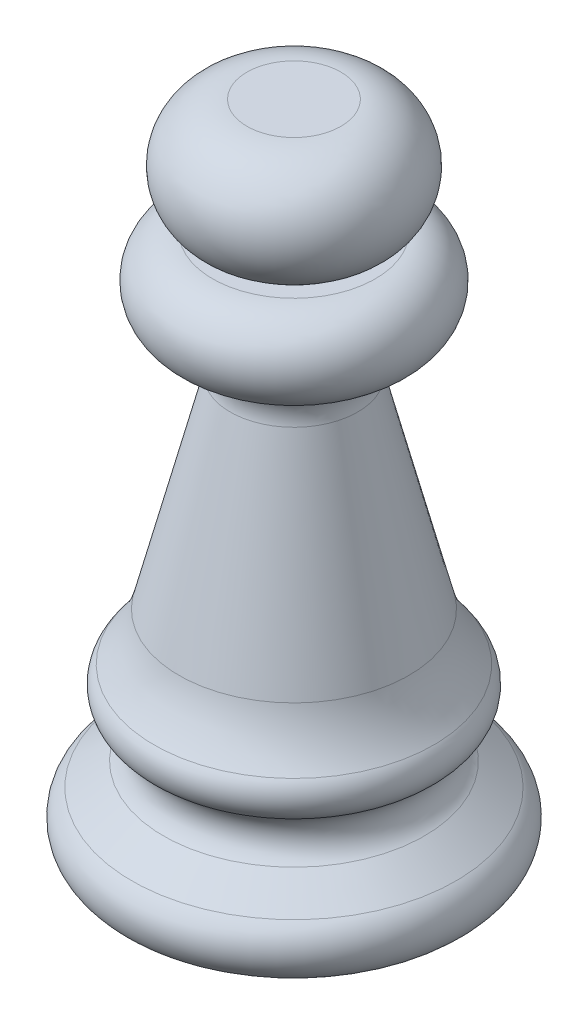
ISO-10303-21;
HEADER;
FILE_DESCRIPTION(('STEP AP214'),'2;1');
FILE_NAME('part.step','',(''),(''),'','','');
FILE_SCHEMA(('AUTOMOTIVE_DESIGN { 1 0 10303 214 1 1 1 1 }'));
ENDSEC;
DATA;
#1=APPLICATION_CONTEXT('core data for automotive mechanical design processes');
#2=APPLICATION_PROTOCOL_DEFINITION('international standard','automotive_design',2000,#1);
#3=PRODUCT_CONTEXT('',#1,'mechanical');
#4=PRODUCT('Part','Part','',(#3));
#5=PRODUCT_RELATED_PRODUCT_CATEGORY('part','',(#4));
#6=PRODUCT_DEFINITION_FORMATION('','',#4);
#7=PRODUCT_DEFINITION_CONTEXT('part definition',#1,'design');
#8=PRODUCT_DEFINITION('design','',#6,#7);
#9=PRODUCT_DEFINITION_SHAPE('','',#8);
#10=(LENGTH_UNIT() NAMED_UNIT(*) SI_UNIT(.MILLI.,.METRE.));
#11=(NAMED_UNIT(*) PLANE_ANGLE_UNIT() SI_UNIT($,.RADIAN.));
#12=(NAMED_UNIT(*) SI_UNIT($,.STERADIAN.) SOLID_ANGLE_UNIT());
#13=UNCERTAINTY_MEASURE_WITH_UNIT(LENGTH_MEASURE(1.E-05),#10,'distance_accuracy_value','');
#14=(GEOMETRIC_REPRESENTATION_CONTEXT(3) GLOBAL_UNCERTAINTY_ASSIGNED_CONTEXT((#13)) GLOBAL_UNIT_ASSIGNED_CONTEXT((#10,
#11,#12)) REPRESENTATION_CONTEXT('',''));
#15=CARTESIAN_POINT('',(0.,0.,0.));
#16=DIRECTION('',(0.,0.,1.));
#17=DIRECTION('',(1.,0.,0.));
#18=AXIS2_PLACEMENT_3D('',#15,#16,#17);
#19=CARTESIAN_POINT('',(0.,0.,0.));
#20=DIRECTION('',(0.,-1.,0.));
#21=DIRECTION('',(0.,0.,-1.));
#22=AXIS2_PLACEMENT_3D('',#19,#20,#21);
#23=PLANE('',#22);
#24=CARTESIAN_POINT('',(0.,0.,0.));
#25=DIRECTION('',(0.,-1.,0.));
#26=DIRECTION('',(0.,0.,-1.));
#27=AXIS2_PLACEMENT_3D('',#24,#25,#26);
#28=CIRCLE('',#27,13.97);
#29=CARTESIAN_POINT('',(0.,0.,-13.97));
#30=VERTEX_POINT('',#29);
#31=EDGE_CURVE('E10',#30,#30,#28,.T.);
#32=ORIENTED_EDGE('',*,*,#31,.T.);
#33=EDGE_LOOP('',(#32));
#34=FACE_BOUND('',#33,.T.);
#35=ADVANCED_FACE('F32',(#34),#23,.T.);
#36=CARTESIAN_POINT('',(0.,3.048,0.));
#37=DIRECTION('',(0.,-1.,0.));
#38=DIRECTION('',(0.,0.,-1.));
#39=AXIS2_PLACEMENT_3D('',#36,#37,#38);
#40=TOROIDAL_SURFACE('',#39,13.97,3.048);
#41=CARTESIAN_POINT('',(0.,5.50802192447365,0.));
#42=DIRECTION('',(0.,-1.,0.));
#43=DIRECTION('',(0.,0.,-1.));
#44=AXIS2_PLACEMENT_3D('',#41,#42,#43);
#45=CIRCLE('',#44,15.7696099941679);
#46=CARTESIAN_POINT('',(0.,5.50802192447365,-15.7696099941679));
#47=VERTEX_POINT('',#46);
#48=EDGE_CURVE('E38',#47,#47,#45,.T.);
#49=ORIENTED_EDGE('',*,*,#48,.T.);
#50=EDGE_LOOP('',(#49));
#51=FACE_BOUND('',#50,.T.);
#52=ORIENTED_EDGE('',*,*,#31,.F.);
#53=EDGE_LOOP('',(#52));
#54=FACE_BOUND('',#53,.T.);
#55=ADVANCED_FACE('F85',(#51,#54),#40,.T.);
#56=CARTESIAN_POINT('',(0.,5.50802192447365,0.));
#57=DIRECTION('',(0.,-1.,0.));
#58=DIRECTION('',(0.,0.,-1.));
#59=AXIS2_PLACEMENT_3D('',#56,#57,#58);
#60=CONICAL_SURFACE('',#59,15.7696099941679,0.939213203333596);
#61=CARTESIAN_POINT('',(0.,7.75753441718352,0.));
#62=DIRECTION('',(0.,-1.,0.));
#63=DIRECTION('',(0.,0.,-1.));
#64=AXIS2_PLACEMENT_3D('',#61,#62,#63);
#65=CIRCLE('',#64,12.6945825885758);
#66=CARTESIAN_POINT('',(0.,7.75753441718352,-12.6945825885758));
#67=VERTEX_POINT('',#66);
#68=EDGE_CURVE('E42',#67,#67,#65,.T.);
#69=ORIENTED_EDGE('',*,*,#68,.T.);
#70=EDGE_LOOP('',(#69));
#71=FACE_BOUND('',#70,.T.);
#72=ORIENTED_EDGE('',*,*,#48,.F.);
#73=EDGE_LOOP('',(#72));
#74=FACE_BOUND('',#73,.T.);
#75=ADVANCED_FACE('F89',(#71,#74),#60,.T.);
#76=CARTESIAN_POINT('',(0.,9.80755268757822,0.));
#77=DIRECTION('',(0.,-1.,0.));
#78=DIRECTION('',(0.,0.,-1.));
#79=AXIS2_PLACEMENT_3D('',#76,#77,#78);
#80=TOROIDAL_SURFACE('',#79,14.1942575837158,2.54);
#81=CARTESIAN_POINT('',(0.,12.0157763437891,0.));
#82=DIRECTION('',(0.,-1.,0.));
#83=DIRECTION('',(0.,0.,-1.));
#84=AXIS2_PLACEMENT_3D('',#81,#82,#83);
#85=CIRCLE('',#84,12.9391287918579);
#86=CARTESIAN_POINT('',(0.,12.0157763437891,-12.9391287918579));
#87=VERTEX_POINT('',#86);
#88=EDGE_CURVE('E46',#87,#87,#85,.T.);
#89=ORIENTED_EDGE('',*,*,#88,.T.);
#90=EDGE_LOOP('',(#89));
#91=FACE_BOUND('',#90,.T.);
#92=ORIENTED_EDGE('',*,*,#68,.F.);
#93=EDGE_LOOP('',(#92));
#94=FACE_BOUND('',#93,.T.);
#95=ADVANCED_FACE('F93',(#91,#94),#80,.F.);
#96=CARTESIAN_POINT('',(0.,14.224,0.));
#97=DIRECTION('',(0.,-1.,0.));
#98=DIRECTION('',(0.,0.,-1.));
#99=AXIS2_PLACEMENT_3D('',#96,#97,#98);
#100=TOROIDAL_SURFACE('',#99,11.684,2.54);
#101=CARTESIAN_POINT('',(0.,15.8818566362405,0.));
#102=DIRECTION('',(0.,-1.,0.));
#103=DIRECTION('',(0.,0.,-1.));
#104=AXIS2_PLACEMENT_3D('',#101,#102,#103);
#105=CIRCLE('',#104,13.6083469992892);
#106=CARTESIAN_POINT('',(0.,15.8818566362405,-13.6083469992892));
#107=VERTEX_POINT('',#106);
#108=EDGE_CURVE('E51',#107,#107,#105,.T.);
#109=ORIENTED_EDGE('',*,*,#108,.T.);
#110=EDGE_LOOP('',(#109));
#111=FACE_BOUND('',#110,.T.);
#112=ORIENTED_EDGE('',*,*,#88,.F.);
#113=EDGE_LOOP('',(#112));
#114=FACE_BOUND('',#113,.T.);
#115=ADVANCED_FACE('F100',(#111,#114),#100,.T.);
#116=CARTESIAN_POINT('',(0.,23.3422114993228,0.));
#117=DIRECTION('',(0.,-1.,0.));
#118=DIRECTION('',(0.,0.,-1.));
#119=AXIS2_PLACEMENT_3D('',#116,#117,#118);
#120=TOROIDAL_SURFACE('',#119,22.2679084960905,11.43);
#121=CARTESIAN_POINT('',(0.,20.5348364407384,0.));
#122=DIRECTION('',(0.,-1.,0.));
#123=DIRECTION('',(0.,0.,-1.));
#124=AXIS2_PLACEMENT_3D('',#121,#122,#123);
#125=CIRCLE('',#124,11.1880373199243);
#126=CARTESIAN_POINT('',(0.,20.5348364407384,-11.1880373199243));
#127=VERTEX_POINT('',#126);
#128=EDGE_CURVE('E54',#127,#127,#125,.T.);
#129=ORIENTED_EDGE('',*,*,#128,.T.);
#130=EDGE_LOOP('',(#129));
#131=FACE_BOUND('',#130,.T.);
#132=ORIENTED_EDGE('',*,*,#108,.F.);
#133=EDGE_LOOP('',(#132));
#134=FACE_BOUND('',#133,.T.);
#135=ADVANCED_FACE('F104',(#131,#134),#120,.F.);
#136=CARTESIAN_POINT('',(0.,20.5348364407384,0.));
#137=DIRECTION('',(0.,-1.,0.));
#138=DIRECTION('',(0.,0.,-1.));
#139=AXIS2_PLACEMENT_3D('',#136,#137,#138);
#140=CONICAL_SURFACE('',#139,11.1880373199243,0.248153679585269);
#141=CARTESIAN_POINT('',(0.,40.2323851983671,0.));
#142=DIRECTION('',(0.,-1.,0.));
#143=DIRECTION('',(0.,0.,-1.));
#144=AXIS2_PLACEMENT_3D('',#141,#142,#143);
#145=CIRCLE('',#144,6.19714832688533);
#146=CARTESIAN_POINT('',(0.,40.2323851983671,-6.19714832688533));
#147=VERTEX_POINT('',#146);
#148=EDGE_CURVE('E57',#147,#147,#145,.T.);
#149=ORIENTED_EDGE('',*,*,#148,.T.);
#150=EDGE_LOOP('',(#149));
#151=FACE_BOUND('',#150,.T.);
#152=ORIENTED_EDGE('',*,*,#128,.F.);
#153=EDGE_LOOP('',(#152));
#154=FACE_BOUND('',#153,.T.);
#155=ADVANCED_FACE('F108',(#151,#154),#140,.T.);
#156=CARTESIAN_POINT('',(0.,41.043404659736,0.));
#157=DIRECTION('',(0.,-1.,0.));
#158=DIRECTION('',(0.,0.,-1.));
#159=AXIS2_PLACEMENT_3D('',#156,#157,#158);
#160=TOROIDAL_SURFACE('',#159,9.398,3.302);
#161=CARTESIAN_POINT('',(0.,44.2784301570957,0.));
#162=DIRECTION('',(0.,-1.,0.));
#163=DIRECTION('',(0.,0.,-1.));
#164=AXIS2_PLACEMENT_3D('',#161,#162,#163);
#165=CIRCLE('',#164,8.73632482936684);
#166=CARTESIAN_POINT('',(0.,44.2784301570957,-8.73632482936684));
#167=VERTEX_POINT('',#166);
#168=EDGE_CURVE('E60',#167,#167,#165,.T.);
#169=ORIENTED_EDGE('',*,*,#168,.T.);
#170=EDGE_LOOP('',(#169));
#171=FACE_BOUND('',#170,.T.);
#172=ORIENTED_EDGE('',*,*,#148,.F.);
#173=EDGE_LOOP('',(#172));
#174=FACE_BOUND('',#173,.T.);
#175=ADVANCED_FACE('F112',(#171,#174),#160,.F.);
#176=CARTESIAN_POINT('',(0.,48.26,0.));
#177=DIRECTION('',(0.,-1.,0.));
#178=DIRECTION('',(0.,0.,-1.));
#179=AXIS2_PLACEMENT_3D('',#176,#177,#178);
#180=TOROIDAL_SURFACE('',#179,7.92195538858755,4.064);
#181=CARTESIAN_POINT('',(0.,52.324,0.));
#182=DIRECTION('',(0.,-1.,0.));
#183=DIRECTION('',(0.,0.,-1.));
#184=AXIS2_PLACEMENT_3D('',#181,#182,#183);
#185=CIRCLE('',#184,7.92195538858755);
#186=CARTESIAN_POINT('',(0.,52.324,-7.92195538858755));
#187=VERTEX_POINT('',#186);
#188=EDGE_CURVE('E63',#187,#187,#185,.T.);
#189=ORIENTED_EDGE('',*,*,#188,.T.);
#190=EDGE_LOOP('',(#189));
#191=FACE_BOUND('',#190,.T.);
#192=ORIENTED_EDGE('',*,*,#168,.F.);
#193=EDGE_LOOP('',(#192));
#194=FACE_BOUND('',#193,.T.);
#195=ADVANCED_FACE('F116',(#191,#194),#180,.T.);
#196=CARTESIAN_POINT('',(7.92195538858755,52.324,0.));
#197=DIRECTION('',(0.,1.,0.));
#198=DIRECTION('',(0.,0.,1.));
#199=AXIS2_PLACEMENT_3D('',#196,#197,#198);
#200=PLANE('',#199);
#201=CARTESIAN_POINT('',(0.,52.324,0.));
#202=DIRECTION('',(0.,-1.,0.));
#203=DIRECTION('',(0.,0.,-1.));
#204=AXIS2_PLACEMENT_3D('',#201,#202,#203);
#205=CIRCLE('',#204,4.572);
#206=CARTESIAN_POINT('',(0.,52.324,-4.572));
#207=VERTEX_POINT('',#206);
#208=EDGE_CURVE('E66',#207,#207,#205,.T.);
#209=ORIENTED_EDGE('',*,*,#208,.T.);
#210=EDGE_LOOP('',(#209));
#211=FACE_BOUND('',#210,.T.);
#212=ORIENTED_EDGE('',*,*,#188,.F.);
#213=EDGE_LOOP('',(#212));
#214=FACE_BOUND('',#213,.T.);
#215=ADVANCED_FACE('F82',(#211,#214),#200,.T.);
#216=CARTESIAN_POINT('',(0.,57.912,0.));
#217=DIRECTION('',(0.,-1.,0.));
#218=DIRECTION('',(0.,0.,-1.));
#219=AXIS2_PLACEMENT_3D('',#216,#217,#218);
#220=DEGENERATE_TOROIDAL_SURFACE('',#219,4.572,5.58800000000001,.T.);
#221=CARTESIAN_POINT('',(0.,63.5,0.));
#222=DIRECTION('',(0.,-1.,0.));
#223=DIRECTION('',(0.,0.,-1.));
#224=AXIS2_PLACEMENT_3D('',#221,#222,#223);
#225=CIRCLE('',#224,4.572);
#226=CARTESIAN_POINT('',(0.,63.5,-4.572));
#227=VERTEX_POINT('',#226);
#228=EDGE_CURVE('E69',#227,#227,#225,.T.);
#229=ORIENTED_EDGE('',*,*,#228,.T.);
#230=EDGE_LOOP('',(#229));
#231=FACE_BOUND('',#230,.T.);
#232=ORIENTED_EDGE('',*,*,#208,.F.);
#233=EDGE_LOOP('',(#232));
#234=FACE_BOUND('',#233,.T.);
#235=ADVANCED_FACE('F73',(#231,#234),#220,.T.);
#236=CARTESIAN_POINT('',(4.572,63.5,0.));
#237=DIRECTION('',(0.,1.,0.));
#238=DIRECTION('',(0.,0.,1.));
#239=AXIS2_PLACEMENT_3D('',#236,#237,#238);
#240=PLANE('',#239);
#241=ORIENTED_EDGE('',*,*,#228,.F.);
#242=EDGE_LOOP('',(#241));
#243=FACE_BOUND('',#242,.T.);
#244=ADVANCED_FACE('F76',(#243),#240,.T.);
#245=CLOSED_SHELL('',(#35,#55,#75,#95,#115,#135,#155,#175,#195,#215,#235,#244));
#246=MANIFOLD_SOLID_BREP('B2',#245);
#247=ADVANCED_BREP_SHAPE_REPRESENTATION('',(#18,#246),#14);
#248=SHAPE_DEFINITION_REPRESENTATION(#9,#247);
ENDSEC;
END-ISO-10303-21;
